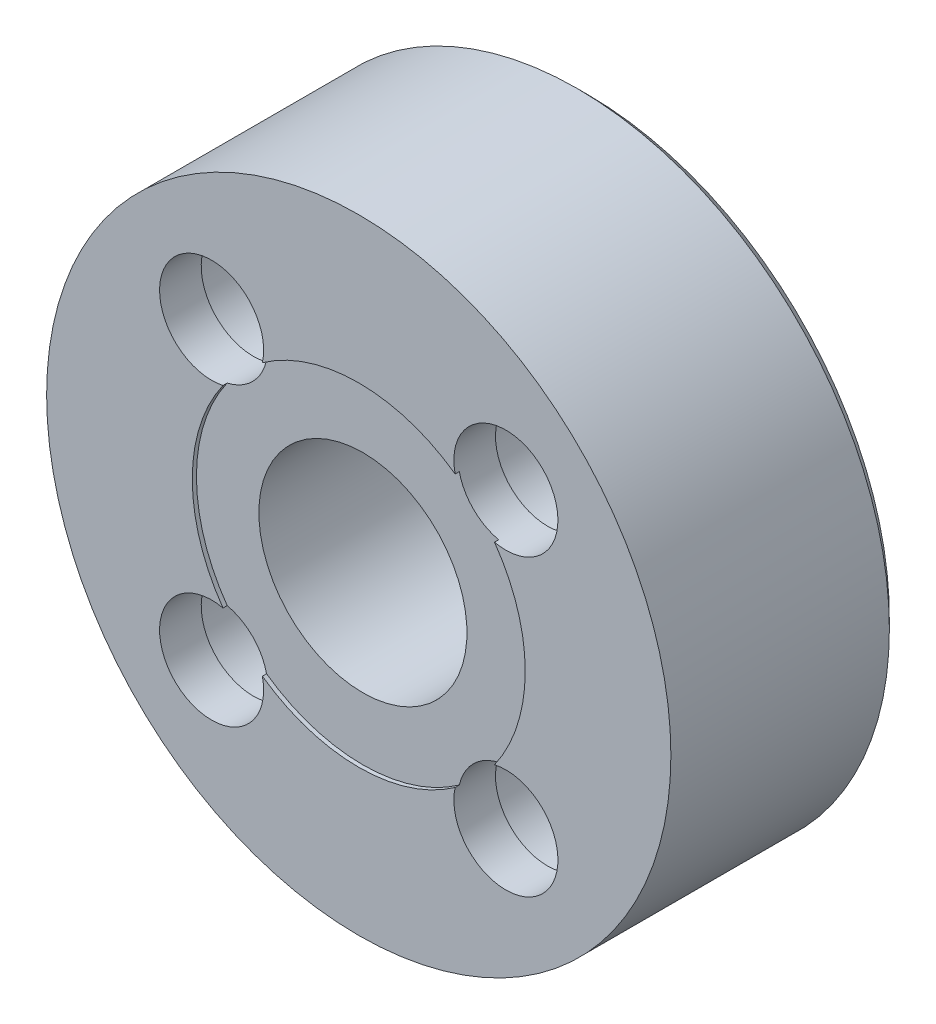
ISO-10303-21;
HEADER;
FILE_DESCRIPTION(('STEP AP214'),'2;1');
FILE_NAME('part.step','',(''),(''),'','','');
FILE_SCHEMA(('AUTOMOTIVE_DESIGN { 1 0 10303 214 1 1 1 1 }'));
ENDSEC;
DATA;
#1=APPLICATION_CONTEXT('core data for automotive mechanical design processes');
#2=APPLICATION_PROTOCOL_DEFINITION('international standard','automotive_design',2000,#1);
#3=PRODUCT_CONTEXT('',#1,'mechanical');
#4=PRODUCT('Part','Part','',(#3));
#5=PRODUCT_RELATED_PRODUCT_CATEGORY('part','',(#4));
#6=PRODUCT_DEFINITION_FORMATION('','',#4);
#7=PRODUCT_DEFINITION_CONTEXT('part definition',#1,'design');
#8=PRODUCT_DEFINITION('design','',#6,#7);
#9=PRODUCT_DEFINITION_SHAPE('','',#8);
#10=(LENGTH_UNIT() NAMED_UNIT(*) SI_UNIT(.MILLI.,.METRE.));
#11=(NAMED_UNIT(*) PLANE_ANGLE_UNIT() SI_UNIT($,.RADIAN.));
#12=(NAMED_UNIT(*) SI_UNIT($,.STERADIAN.) SOLID_ANGLE_UNIT());
#13=UNCERTAINTY_MEASURE_WITH_UNIT(LENGTH_MEASURE(1.E-05),#10,'distance_accuracy_value','');
#14=(GEOMETRIC_REPRESENTATION_CONTEXT(3) GLOBAL_UNCERTAINTY_ASSIGNED_CONTEXT((#13)) GLOBAL_UNIT_ASSIGNED_CONTEXT((#10,
#11,#12)) REPRESENTATION_CONTEXT('',''));
#15=CARTESIAN_POINT('',(0.,0.,0.));
#16=DIRECTION('',(0.,0.,1.));
#17=DIRECTION('',(1.,0.,0.));
#18=AXIS2_PLACEMENT_3D('',#15,#16,#17);
#19=CARTESIAN_POINT('',(0.,0.,0.));
#20=DIRECTION('',(0.,0.,-1.));
#21=DIRECTION('',(0.,-1.,0.));
#22=AXIS2_PLACEMENT_3D('',#19,#20,#21);
#23=CYLINDRICAL_SURFACE('',#22,5.);
#24=CARTESIAN_POINT('',(0.,0.,0.5));
#25=DIRECTION('',(0.,0.,1.));
#26=DIRECTION('',(0.,1.,0.));
#27=AXIS2_PLACEMENT_3D('',#24,#25,#26);
#28=CIRCLE('',#27,5.);
#29=CARTESIAN_POINT('',(0.,5.,0.5));
#30=VERTEX_POINT('',#29);
#31=EDGE_CURVE('E126',#30,#30,#28,.F.);
#32=ORIENTED_EDGE('',*,*,#31,.T.);
#33=EDGE_LOOP('',(#32));
#34=FACE_BOUND('',#33,.T.);
#35=CARTESIAN_POINT('',(0.,0.,10.8));
#36=DIRECTION('',(0.,0.,-1.));
#37=DIRECTION('',(0.,-1.,0.));
#38=AXIS2_PLACEMENT_3D('',#35,#36,#37);
#39=CIRCLE('',#38,5.);
#40=CARTESIAN_POINT('',(0.,-5.,10.8));
#41=VERTEX_POINT('',#40);
#42=EDGE_CURVE('E97',#41,#41,#39,.F.);
#43=ORIENTED_EDGE('',*,*,#42,.T.);
#44=EDGE_LOOP('',(#43));
#45=FACE_BOUND('',#44,.T.);
#46=ADVANCED_FACE('F14',(#34,#45),#23,.F.);
#47=CARTESIAN_POINT('',(-7.07106781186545,7.0710678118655,0.));
#48=DIRECTION('',(0.,0.,-1.));
#49=DIRECTION('',(0.,-1.,0.));
#50=AXIS2_PLACEMENT_3D('',#47,#48,#49);
#51=CYLINDRICAL_SURFACE('',#50,2.5);
#52=DIRECTION('',(0.,0.,-1.));
#53=VECTOR('',#52,1.);
#54=CARTESIAN_POINT('',(-4.63196253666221,6.52264693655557,15.8));
#55=LINE('',#54,#53);
#56=CARTESIAN_POINT('',(-4.63196253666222,6.52264693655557,10.8));
#57=VERTEX_POINT('',#56);
#58=CARTESIAN_POINT('',(-4.6319625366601,6.52264693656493,11.));
#59=VERTEX_POINT('',#58);
#60=EDGE_CURVE('E108',#57,#59,#55,.F.);
#61=ORIENTED_EDGE('',*,*,#60,.T.);
#62=CARTESIAN_POINT('',(-7.07106781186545,7.0710678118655,11.));
#63=DIRECTION('',(0.,0.,-1.));
#64=DIRECTION('',(0.,-1.,0.));
#65=AXIS2_PLACEMENT_3D('',#62,#63,#64);
#66=CIRCLE('',#65,2.5);
#67=CARTESIAN_POINT('',(-6.52264693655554,4.63196253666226,11.));
#68=VERTEX_POINT('',#67);
#69=EDGE_CURVE('E217',#59,#68,#66,.F.);
#70=ORIENTED_EDGE('',*,*,#69,.T.);
#71=DIRECTION('',(0.,0.,-1.));
#72=VECTOR('',#71,1.);
#73=CARTESIAN_POINT('',(-6.52264693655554,4.63196253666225,15.8));
#74=LINE('',#73,#72);
#75=CARTESIAN_POINT('',(-6.52264693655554,4.63196253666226,10.8));
#76=VERTEX_POINT('',#75);
#77=EDGE_CURVE('E111',#68,#76,#74,.T.);
#78=ORIENTED_EDGE('',*,*,#77,.T.);
#79=CARTESIAN_POINT('',(-7.07106781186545,7.0710678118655,10.8));
#80=DIRECTION('',(0.,0.,-1.));
#81=DIRECTION('',(0.,-1.,0.));
#82=AXIS2_PLACEMENT_3D('',#79,#80,#81);
#83=CIRCLE('',#82,2.5);
#84=EDGE_CURVE('E188',#76,#57,#83,.F.);
#85=ORIENTED_EDGE('',*,*,#84,.T.);
#86=EDGE_LOOP('',(#61,#70,#78,#85));
#87=FACE_BOUND('',#86,.T.);
#88=CARTESIAN_POINT('',(-7.07106781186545,7.0710678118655,9.));
#89=DIRECTION('',(0.,0.,-1.));
#90=DIRECTION('',(0.,-1.,0.));
#91=AXIS2_PLACEMENT_3D('',#88,#89,#90);
#92=CIRCLE('',#91,2.5);
#93=CARTESIAN_POINT('',(-7.07106781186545,4.5710678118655,9.));
#94=VERTEX_POINT('',#93);
#95=EDGE_CURVE('E164',#94,#94,#92,.F.);
#96=ORIENTED_EDGE('',*,*,#95,.F.);
#97=EDGE_LOOP('',(#96));
#98=FACE_BOUND('',#97,.T.);
#99=ADVANCED_FACE('F221',(#87,#98),#51,.F.);
#100=CARTESIAN_POINT('',(7.07106781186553,7.07106781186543,0.));
#101=DIRECTION('',(0.,0.,-1.));
#102=DIRECTION('',(0.,-1.,0.));
#103=AXIS2_PLACEMENT_3D('',#100,#101,#102);
#104=CYLINDRICAL_SURFACE('',#103,2.5);
#105=DIRECTION('',(0.,0.,-1.));
#106=VECTOR('',#105,1.);
#107=CARTESIAN_POINT('',(6.52264693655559,4.63196253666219,15.8));
#108=LINE('',#107,#106);
#109=CARTESIAN_POINT('',(6.52264693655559,4.63196253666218,10.8));
#110=VERTEX_POINT('',#109);
#111=CARTESIAN_POINT('',(6.52264693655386,4.63196253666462,11.));
#112=VERTEX_POINT('',#111);
#113=EDGE_CURVE('E96',#110,#112,#108,.F.);
#114=ORIENTED_EDGE('',*,*,#113,.T.);
#115=CARTESIAN_POINT('',(7.07106781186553,7.07106781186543,11.));
#116=DIRECTION('',(0.,0.,-1.));
#117=DIRECTION('',(0.,-1.,0.));
#118=AXIS2_PLACEMENT_3D('',#115,#116,#117);
#119=CIRCLE('',#118,2.5);
#120=CARTESIAN_POINT('',(4.63196253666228,6.52264693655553,11.));
#121=VERTEX_POINT('',#120);
#122=EDGE_CURVE('E212',#112,#121,#119,.F.);
#123=ORIENTED_EDGE('',*,*,#122,.T.);
#124=DIRECTION('',(0.,0.,-1.));
#125=VECTOR('',#124,1.);
#126=CARTESIAN_POINT('',(4.63196253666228,6.52264693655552,15.8));
#127=LINE('',#126,#125);
#128=CARTESIAN_POINT('',(4.63196253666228,6.52264693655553,10.8));
#129=VERTEX_POINT('',#128);
#130=EDGE_CURVE('E100',#121,#129,#127,.T.);
#131=ORIENTED_EDGE('',*,*,#130,.T.);
#132=CARTESIAN_POINT('',(7.07106781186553,7.07106781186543,10.8));
#133=DIRECTION('',(0.,0.,-1.));
#134=DIRECTION('',(0.,-1.,0.));
#135=AXIS2_PLACEMENT_3D('',#132,#133,#134);
#136=CIRCLE('',#135,2.5);
#137=EDGE_CURVE('E185',#129,#110,#136,.F.);
#138=ORIENTED_EDGE('',*,*,#137,.T.);
#139=EDGE_LOOP('',(#114,#123,#131,#138));
#140=FACE_BOUND('',#139,.T.);
#141=CARTESIAN_POINT('',(7.07106781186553,7.07106781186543,9.));
#142=DIRECTION('',(0.,0.,-1.));
#143=DIRECTION('',(0.,-1.,0.));
#144=AXIS2_PLACEMENT_3D('',#141,#142,#143);
#145=CIRCLE('',#144,2.5);
#146=CARTESIAN_POINT('',(7.07106781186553,4.57106781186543,9.));
#147=VERTEX_POINT('',#146);
#148=EDGE_CURVE('E157',#147,#147,#145,.F.);
#149=ORIENTED_EDGE('',*,*,#148,.F.);
#150=EDGE_LOOP('',(#149));
#151=FACE_BOUND('',#150,.T.);
#152=ADVANCED_FACE('F209',(#140,#151),#104,.F.);
#153=CARTESIAN_POINT('',(7.0710678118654,-7.07106781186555,0.));
#154=DIRECTION('',(0.,0.,-1.));
#155=DIRECTION('',(0.,-1.,0.));
#156=AXIS2_PLACEMENT_3D('',#153,#154,#155);
#157=CYLINDRICAL_SURFACE('',#156,2.5);
#158=DIRECTION('',(0.,0.,-1.));
#159=VECTOR('',#158,1.);
#160=CARTESIAN_POINT('',(4.63196253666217,-6.5226469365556,15.8));
#161=LINE('',#160,#159);
#162=CARTESIAN_POINT('',(4.63196253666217,-6.5226469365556,10.8));
#163=VERTEX_POINT('',#162);
#164=CARTESIAN_POINT('',(4.63196253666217,-6.5226469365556,11.));
#165=VERTEX_POINT('',#164);
#166=EDGE_CURVE('E140',#163,#165,#161,.F.);
#167=ORIENTED_EDGE('',*,*,#166,.T.);
#168=CARTESIAN_POINT('',(7.0710678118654,-7.07106781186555,11.));
#169=DIRECTION('',(0.,0.,-1.));
#170=DIRECTION('',(0.,-1.,0.));
#171=AXIS2_PLACEMENT_3D('',#168,#169,#170);
#172=CIRCLE('',#171,2.5);
#173=CARTESIAN_POINT('',(6.5226469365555,-4.6319625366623,11.));
#174=VERTEX_POINT('',#173);
#175=EDGE_CURVE('E83',#165,#174,#172,.F.);
#176=ORIENTED_EDGE('',*,*,#175,.T.);
#177=DIRECTION('',(0.,0.,-1.));
#178=VECTOR('',#177,1.);
#179=CARTESIAN_POINT('',(6.52264693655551,-4.6319625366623,15.8));
#180=LINE('',#179,#178);
#181=CARTESIAN_POINT('',(6.5226469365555,-4.63196253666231,10.8));
#182=VERTEX_POINT('',#181);
#183=EDGE_CURVE('E21',#174,#182,#180,.T.);
#184=ORIENTED_EDGE('',*,*,#183,.T.);
#185=CARTESIAN_POINT('',(7.0710678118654,-7.07106781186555,10.8));
#186=DIRECTION('',(0.,0.,-1.));
#187=DIRECTION('',(0.,-1.,0.));
#188=AXIS2_PLACEMENT_3D('',#185,#186,#187);
#189=CIRCLE('',#188,2.5);
#190=EDGE_CURVE('E138',#182,#163,#189,.F.);
#191=ORIENTED_EDGE('',*,*,#190,.T.);
#192=EDGE_LOOP('',(#167,#176,#184,#191));
#193=FACE_BOUND('',#192,.T.);
#194=CARTESIAN_POINT('',(7.0710678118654,-7.07106781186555,9.));
#195=DIRECTION('',(0.,0.,-1.));
#196=DIRECTION('',(0.,-1.,0.));
#197=AXIS2_PLACEMENT_3D('',#194,#195,#196);
#198=CIRCLE('',#197,2.5);
#199=CARTESIAN_POINT('',(7.0710678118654,-9.57106781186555,9.));
#200=VERTEX_POINT('',#199);
#201=EDGE_CURVE('E150',#200,#200,#198,.F.);
#202=ORIENTED_EDGE('',*,*,#201,.F.);
#203=EDGE_LOOP('',(#202));
#204=FACE_BOUND('',#203,.T.);
#205=ADVANCED_FACE('F288',(#193,#204),#157,.F.);
#206=CARTESIAN_POINT('',(-7.07106781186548,-7.07106781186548,0.));
#207=DIRECTION('',(0.,0.,-1.));
#208=DIRECTION('',(0.,-1.,0.));
#209=AXIS2_PLACEMENT_3D('',#206,#207,#208);
#210=CYLINDRICAL_SURFACE('',#209,2.5);
#211=DIRECTION('',(0.,0.,-1.));
#212=VECTOR('',#211,1.);
#213=CARTESIAN_POINT('',(-6.52264693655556,-4.63196253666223,15.8));
#214=LINE('',#213,#212);
#215=CARTESIAN_POINT('',(-6.52264693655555,-4.63196253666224,10.8));
#216=VERTEX_POINT('',#215);
#217=CARTESIAN_POINT('',(-6.52264693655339,-4.63196253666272,11.));
#218=VERTEX_POINT('',#217);
#219=EDGE_CURVE('E93',#216,#218,#214,.F.);
#220=ORIENTED_EDGE('',*,*,#219,.T.);
#221=CARTESIAN_POINT('',(-7.07106781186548,-7.07106781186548,11.));
#222=DIRECTION('',(0.,0.,-1.));
#223=DIRECTION('',(0.,-1.,0.));
#224=AXIS2_PLACEMENT_3D('',#221,#222,#223);
#225=CIRCLE('',#224,2.5);
#226=CARTESIAN_POINT('',(-4.63196253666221,-6.52264693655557,11.));
#227=VERTEX_POINT('',#226);
#228=EDGE_CURVE('E81',#218,#227,#225,.F.);
#229=ORIENTED_EDGE('',*,*,#228,.T.);
#230=DIRECTION('',(0.,0.,-1.));
#231=VECTOR('',#230,1.);
#232=CARTESIAN_POINT('',(-4.63196253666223,-6.52264693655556,15.8));
#233=LINE('',#232,#231);
#234=CARTESIAN_POINT('',(-4.63196253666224,-6.52264693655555,10.8));
#235=VERTEX_POINT('',#234);
#236=EDGE_CURVE('E92',#227,#235,#233,.T.);
#237=ORIENTED_EDGE('',*,*,#236,.T.);
#238=CARTESIAN_POINT('',(-7.07106781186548,-7.07106781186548,10.8));
#239=DIRECTION('',(0.,0.,-1.));
#240=DIRECTION('',(0.,-1.,0.));
#241=AXIS2_PLACEMENT_3D('',#238,#239,#240);
#242=CIRCLE('',#241,2.5);
#243=EDGE_CURVE('E103',#235,#216,#242,.F.);
#244=ORIENTED_EDGE('',*,*,#243,.T.);
#245=EDGE_LOOP('',(#220,#229,#237,#244));
#246=FACE_BOUND('',#245,.T.);
#247=CARTESIAN_POINT('',(-7.07106781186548,-7.07106781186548,9.));
#248=DIRECTION('',(0.,0.,-1.));
#249=DIRECTION('',(0.,-1.,0.));
#250=AXIS2_PLACEMENT_3D('',#247,#248,#249);
#251=CIRCLE('',#250,2.5);
#252=CARTESIAN_POINT('',(-7.07106781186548,-9.57106781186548,9.));
#253=VERTEX_POINT('',#252);
#254=EDGE_CURVE('E143',#253,#253,#251,.F.);
#255=ORIENTED_EDGE('',*,*,#254,.F.);
#256=EDGE_LOOP('',(#255));
#257=FACE_BOUND('',#256,.T.);
#258=ADVANCED_FACE('F89',(#246,#257),#210,.F.);
#259=CARTESIAN_POINT('',(0.,0.,0.));
#260=DIRECTION('',(0.,0.,-1.));
#261=DIRECTION('',(0.,-1.,0.));
#262=AXIS2_PLACEMENT_3D('',#259,#260,#261);
#263=CYLINDRICAL_SURFACE('',#262,15.);
#264=CARTESIAN_POINT('',(0.,0.,11.));
#265=DIRECTION('',(0.,0.,-1.));
#266=DIRECTION('',(0.,-1.,0.));
#267=AXIS2_PLACEMENT_3D('',#264,#265,#266);
#268=CIRCLE('',#267,15.);
#269=CARTESIAN_POINT('',(0.,-15.,11.));
#270=VERTEX_POINT('',#269);
#271=EDGE_CURVE('E216',#270,#270,#268,.T.);
#272=ORIENTED_EDGE('',*,*,#271,.T.);
#273=EDGE_LOOP('',(#272));
#274=FACE_BOUND('',#273,.T.);
#275=CARTESIAN_POINT('',(0.,0.,0.5));
#276=DIRECTION('',(0.,0.,1.));
#277=DIRECTION('',(0.,1.,0.));
#278=AXIS2_PLACEMENT_3D('',#275,#276,#277);
#279=CIRCLE('',#278,15.);
#280=CARTESIAN_POINT('',(0.,15.,0.5));
#281=VERTEX_POINT('',#280);
#282=EDGE_CURVE('E135',#281,#281,#279,.T.);
#283=ORIENTED_EDGE('',*,*,#282,.T.);
#284=EDGE_LOOP('',(#283));
#285=FACE_BOUND('',#284,.T.);
#286=ADVANCED_FACE('F306',(#274,#285),#263,.T.);
#287=CARTESIAN_POINT('',(0.,5.,0.));
#288=DIRECTION('',(0.,0.,1.));
#289=DIRECTION('',(0.,1.,0.));
#290=AXIS2_PLACEMENT_3D('',#287,#288,#289);
#291=PLANE('',#290);
#292=CARTESIAN_POINT('',(0.,0.,0.));
#293=DIRECTION('',(0.,0.,1.));
#294=DIRECTION('',(0.,1.,0.));
#295=AXIS2_PLACEMENT_3D('',#292,#293,#294);
#296=CIRCLE('',#295,14.5);
#297=CARTESIAN_POINT('',(0.,14.5,0.));
#298=VERTEX_POINT('',#297);
#299=EDGE_CURVE('E132',#298,#298,#296,.F.);
#300=ORIENTED_EDGE('',*,*,#299,.T.);
#301=EDGE_LOOP('',(#300));
#302=FACE_BOUND('',#301,.T.);
#303=CARTESIAN_POINT('',(0.,0.,0.));
#304=DIRECTION('',(0.,0.,1.));
#305=DIRECTION('',(0.,1.,0.));
#306=AXIS2_PLACEMENT_3D('',#303,#304,#305);
#307=CIRCLE('',#306,5.5);
#308=CARTESIAN_POINT('',(0.,5.5,0.));
#309=VERTEX_POINT('',#308);
#310=EDGE_CURVE('E129',#309,#309,#307,.T.);
#311=ORIENTED_EDGE('',*,*,#310,.T.);
#312=EDGE_LOOP('',(#311));
#313=FACE_BOUND('',#312,.T.);
#314=CARTESIAN_POINT('',(7.0710678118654,-7.07106781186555,0.));
#315=DIRECTION('',(0.,0.,-1.));
#316=DIRECTION('',(0.,-1.,0.));
#317=AXIS2_PLACEMENT_3D('',#314,#315,#316);
#318=CIRCLE('',#317,3.5);
#319=CARTESIAN_POINT('',(7.0710678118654,-10.5710678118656,0.));
#320=VERTEX_POINT('',#319);
#321=EDGE_CURVE('E114',#320,#320,#318,.T.);
#322=ORIENTED_EDGE('',*,*,#321,.F.);
#323=EDGE_LOOP('',(#322));
#324=FACE_BOUND('',#323,.T.);
#325=CARTESIAN_POINT('',(7.07106781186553,7.07106781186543,0.));
#326=DIRECTION('',(0.,0.,-1.));
#327=DIRECTION('',(0.,-1.,0.));
#328=AXIS2_PLACEMENT_3D('',#325,#326,#327);
#329=CIRCLE('',#328,3.5);
#330=CARTESIAN_POINT('',(7.07106781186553,3.57106781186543,0.));
#331=VERTEX_POINT('',#330);
#332=EDGE_CURVE('E117',#331,#331,#329,.T.);
#333=ORIENTED_EDGE('',*,*,#332,.F.);
#334=EDGE_LOOP('',(#333));
#335=FACE_BOUND('',#334,.T.);
#336=CARTESIAN_POINT('',(-7.07106781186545,7.0710678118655,0.));
#337=DIRECTION('',(0.,0.,-1.));
#338=DIRECTION('',(0.,-1.,0.));
#339=AXIS2_PLACEMENT_3D('',#336,#337,#338);
#340=CIRCLE('',#339,3.5);
#341=CARTESIAN_POINT('',(-7.07106781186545,3.5710678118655,0.));
#342=VERTEX_POINT('',#341);
#343=EDGE_CURVE('E120',#342,#342,#340,.T.);
#344=ORIENTED_EDGE('',*,*,#343,.F.);
#345=EDGE_LOOP('',(#344));
#346=FACE_BOUND('',#345,.T.);
#347=CARTESIAN_POINT('',(-7.07106781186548,-7.07106781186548,0.));
#348=DIRECTION('',(0.,0.,-1.));
#349=DIRECTION('',(0.,-1.,0.));
#350=AXIS2_PLACEMENT_3D('',#347,#348,#349);
#351=CIRCLE('',#350,3.5);
#352=CARTESIAN_POINT('',(-7.07106781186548,-10.5710678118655,0.));
#353=VERTEX_POINT('',#352);
#354=EDGE_CURVE('E123',#353,#353,#351,.T.);
#355=ORIENTED_EDGE('',*,*,#354,.F.);
#356=EDGE_LOOP('',(#355));
#357=FACE_BOUND('',#356,.T.);
#358=ADVANCED_FACE('F309',(#302,#313,#324,#335,#346,#357),#291,.F.);
#359=CARTESIAN_POINT('',(-7.07106781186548,-7.07106781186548,0.));
#360=DIRECTION('',(0.,0.,-1.));
#361=DIRECTION('',(0.,-1.,0.));
#362=AXIS2_PLACEMENT_3D('',#359,#360,#361);
#363=CONICAL_SURFACE('',#362,3.5,0.785398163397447);
#364=CARTESIAN_POINT('',(-7.07106781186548,-7.07106781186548,0.5));
#365=DIRECTION('',(0.,0.,-1.));
#366=DIRECTION('',(0.,-1.,0.));
#367=AXIS2_PLACEMENT_3D('',#364,#365,#366);
#368=CIRCLE('',#367,3.);
#369=CARTESIAN_POINT('',(-7.07106781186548,-10.0710678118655,0.5));
#370=VERTEX_POINT('',#369);
#371=EDGE_CURVE('E146',#370,#370,#368,.F.);
#372=ORIENTED_EDGE('',*,*,#371,.T.);
#373=EDGE_LOOP('',(#372));
#374=FACE_BOUND('',#373,.T.);
#375=ORIENTED_EDGE('',*,*,#354,.T.);
#376=EDGE_LOOP('',(#375));
#377=FACE_BOUND('',#376,.T.);
#378=ADVANCED_FACE('F303',(#374,#377),#363,.F.);
#379=CARTESIAN_POINT('',(-7.07106781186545,7.0710678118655,0.));
#380=DIRECTION('',(0.,0.,-1.));
#381=DIRECTION('',(0.,-1.,0.));
#382=AXIS2_PLACEMENT_3D('',#379,#380,#381);
#383=CONICAL_SURFACE('',#382,3.5,0.785398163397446);
#384=CARTESIAN_POINT('',(-7.07106781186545,7.0710678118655,0.5));
#385=DIRECTION('',(0.,0.,-1.));
#386=DIRECTION('',(0.,-1.,0.));
#387=AXIS2_PLACEMENT_3D('',#384,#385,#386);
#388=CIRCLE('',#387,3.);
#389=CARTESIAN_POINT('',(-7.07106781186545,4.0710678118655,0.5));
#390=VERTEX_POINT('',#389);
#391=EDGE_CURVE('E166',#390,#390,#388,.F.);
#392=ORIENTED_EDGE('',*,*,#391,.T.);
#393=EDGE_LOOP('',(#392));
#394=FACE_BOUND('',#393,.T.);
#395=ORIENTED_EDGE('',*,*,#343,.T.);
#396=EDGE_LOOP('',(#395));
#397=FACE_BOUND('',#396,.T.);
#398=ADVANCED_FACE('F298',(#394,#397),#383,.F.);
#399=CARTESIAN_POINT('',(7.07106781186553,7.07106781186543,0.));
#400=DIRECTION('',(0.,0.,-1.));
#401=DIRECTION('',(0.,-1.,0.));
#402=AXIS2_PLACEMENT_3D('',#399,#400,#401);
#403=CONICAL_SURFACE('',#402,3.5,0.785398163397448);
#404=CARTESIAN_POINT('',(7.07106781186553,7.07106781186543,0.5));
#405=DIRECTION('',(0.,0.,-1.));
#406=DIRECTION('',(0.,-1.,0.));
#407=AXIS2_PLACEMENT_3D('',#404,#405,#406);
#408=CIRCLE('',#407,3.);
#409=CARTESIAN_POINT('',(7.07106781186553,4.07106781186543,0.5));
#410=VERTEX_POINT('',#409);
#411=EDGE_CURVE('E160',#410,#410,#408,.F.);
#412=ORIENTED_EDGE('',*,*,#411,.T.);
#413=EDGE_LOOP('',(#412));
#414=FACE_BOUND('',#413,.T.);
#415=ORIENTED_EDGE('',*,*,#332,.T.);
#416=EDGE_LOOP('',(#415));
#417=FACE_BOUND('',#416,.T.);
#418=ADVANCED_FACE('F293',(#414,#417),#403,.F.);
#419=CARTESIAN_POINT('',(7.0710678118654,-7.07106781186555,0.));
#420=DIRECTION('',(0.,0.,-1.));
#421=DIRECTION('',(0.,-1.,0.));
#422=AXIS2_PLACEMENT_3D('',#419,#420,#421);
#423=CONICAL_SURFACE('',#422,3.5,0.785398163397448);
#424=CARTESIAN_POINT('',(7.0710678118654,-7.07106781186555,0.5));
#425=DIRECTION('',(0.,0.,-1.));
#426=DIRECTION('',(0.,-1.,0.));
#427=AXIS2_PLACEMENT_3D('',#424,#425,#426);
#428=CIRCLE('',#427,3.);
#429=CARTESIAN_POINT('',(7.0710678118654,-10.0710678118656,0.5));
#430=VERTEX_POINT('',#429);
#431=EDGE_CURVE('E153',#430,#430,#428,.F.);
#432=ORIENTED_EDGE('',*,*,#431,.T.);
#433=EDGE_LOOP('',(#432));
#434=FACE_BOUND('',#433,.T.);
#435=ORIENTED_EDGE('',*,*,#321,.T.);
#436=EDGE_LOOP('',(#435));
#437=FACE_BOUND('',#436,.T.);
#438=ADVANCED_FACE('F286',(#434,#437),#423,.F.);
#439=CARTESIAN_POINT('',(0.,0.,0.5));
#440=DIRECTION('',(0.,0.,-1.));
#441=DIRECTION('',(0.,-1.,0.));
#442=AXIS2_PLACEMENT_3D('',#439,#440,#441);
#443=CONICAL_SURFACE('',#442,5.,0.78539816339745);
#444=ORIENTED_EDGE('',*,*,#310,.F.);
#445=EDGE_LOOP('',(#444));
#446=FACE_BOUND('',#445,.T.);
#447=ORIENTED_EDGE('',*,*,#31,.F.);
#448=EDGE_LOOP('',(#447));
#449=FACE_BOUND('',#448,.T.);
#450=ADVANCED_FACE('F282',(#446,#449),#443,.F.);
#451=CARTESIAN_POINT('',(0.,0.,0.));
#452=DIRECTION('',(0.,0.,1.));
#453=DIRECTION('',(0.,1.,0.));
#454=AXIS2_PLACEMENT_3D('',#451,#452,#453);
#455=CONICAL_SURFACE('',#454,14.5,0.785398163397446);
#456=ORIENTED_EDGE('',*,*,#282,.F.);
#457=EDGE_LOOP('',(#456));
#458=FACE_BOUND('',#457,.T.);
#459=ORIENTED_EDGE('',*,*,#299,.F.);
#460=EDGE_LOOP('',(#459));
#461=FACE_BOUND('',#460,.T.);
#462=ADVANCED_FACE('F279',(#458,#461),#455,.T.);
#463=CARTESIAN_POINT('',(0.,0.,20.8));
#464=DIRECTION('',(0.,0.,-1.));
#465=DIRECTION('',(0.,-1.,0.));
#466=AXIS2_PLACEMENT_3D('',#463,#464,#465);
#467=CYLINDRICAL_SURFACE('',#466,8.);
#468=ORIENTED_EDGE('',*,*,#77,.F.);
#469=CARTESIAN_POINT('',(0.,0.,11.));
#470=DIRECTION('',(0.,0.,-1.));
#471=DIRECTION('',(0.,-1.,0.));
#472=AXIS2_PLACEMENT_3D('',#469,#470,#471);
#473=CIRCLE('',#472,8.);
#474=EDGE_CURVE('E224',#68,#218,#473,.F.);
#475=ORIENTED_EDGE('',*,*,#474,.T.);
#476=ORIENTED_EDGE('',*,*,#219,.F.);
#477=CARTESIAN_POINT('',(0.,0.,10.8));
#478=DIRECTION('',(0.,0.,-1.));
#479=DIRECTION('',(0.,-1.,0.));
#480=AXIS2_PLACEMENT_3D('',#477,#478,#479);
#481=CIRCLE('',#480,8.);
#482=EDGE_CURVE('E184',#216,#76,#481,.T.);
#483=ORIENTED_EDGE('',*,*,#482,.T.);
#484=EDGE_LOOP('',(#468,#475,#476,#483));
#485=FACE_BOUND('',#484,.T.);
#486=ADVANCED_FACE('F223',(#485),#467,.F.);
#487=ORIENTED_EDGE('',*,*,#130,.F.);
#488=CARTESIAN_POINT('',(0.,0.,11.));
#489=DIRECTION('',(0.,0.,-1.));
#490=DIRECTION('',(0.,-1.,0.));
#491=AXIS2_PLACEMENT_3D('',#488,#489,#490);
#492=CIRCLE('',#491,8.);
#493=EDGE_CURVE('E215',#121,#59,#492,.F.);
#494=ORIENTED_EDGE('',*,*,#493,.T.);
#495=ORIENTED_EDGE('',*,*,#60,.F.);
#496=EDGE_CURVE('E198',#57,#129,#481,.T.);
#497=ORIENTED_EDGE('',*,*,#496,.T.);
#498=EDGE_LOOP('',(#487,#494,#495,#497));
#499=FACE_BOUND('',#498,.T.);
#500=ADVANCED_FACE('F214',(#499),#467,.F.);
#501=ORIENTED_EDGE('',*,*,#183,.F.);
#502=CARTESIAN_POINT('',(0.,0.,11.));
#503=DIRECTION('',(0.,0.,-1.));
#504=DIRECTION('',(0.,-1.,0.));
#505=AXIS2_PLACEMENT_3D('',#502,#503,#504);
#506=CIRCLE('',#505,8.);
#507=EDGE_CURVE('E225',#174,#112,#506,.F.);
#508=ORIENTED_EDGE('',*,*,#507,.T.);
#509=ORIENTED_EDGE('',*,*,#113,.F.);
#510=EDGE_CURVE('E183',#110,#182,#481,.T.);
#511=ORIENTED_EDGE('',*,*,#510,.T.);
#512=EDGE_LOOP('',(#501,#508,#509,#511));
#513=FACE_BOUND('',#512,.T.);
#514=ADVANCED_FACE('F205',(#513),#467,.F.);
#515=CARTESIAN_POINT('',(0.,0.,11.));
#516=DIRECTION('',(0.,0.,-1.));
#517=DIRECTION('',(0.,-1.,0.));
#518=AXIS2_PLACEMENT_3D('',#515,#516,#517);
#519=CIRCLE('',#518,8.);
#520=EDGE_CURVE('E9',#227,#165,#519,.F.);
#521=ORIENTED_EDGE('',*,*,#520,.T.);
#522=ORIENTED_EDGE('',*,*,#166,.F.);
#523=EDGE_CURVE('E28',#163,#235,#481,.T.);
#524=ORIENTED_EDGE('',*,*,#523,.T.);
#525=ORIENTED_EDGE('',*,*,#236,.F.);
#526=EDGE_LOOP('',(#521,#522,#524,#525));
#527=FACE_BOUND('',#526,.T.);
#528=ADVANCED_FACE('F95',(#527),#467,.F.);
#529=CARTESIAN_POINT('',(0.,0.,10.8));
#530=DIRECTION('',(0.,0.,-1.));
#531=DIRECTION('',(0.,-1.,0.));
#532=AXIS2_PLACEMENT_3D('',#529,#530,#531);
#533=PLANE('',#532);
#534=ORIENTED_EDGE('',*,*,#523,.F.);
#535=ORIENTED_EDGE('',*,*,#190,.F.);
#536=ORIENTED_EDGE('',*,*,#510,.F.);
#537=ORIENTED_EDGE('',*,*,#137,.F.);
#538=ORIENTED_EDGE('',*,*,#496,.F.);
#539=ORIENTED_EDGE('',*,*,#84,.F.);
#540=ORIENTED_EDGE('',*,*,#482,.F.);
#541=ORIENTED_EDGE('',*,*,#243,.F.);
#542=EDGE_LOOP('',(#534,#535,#536,#537,#538,#539,#540,#541));
#543=FACE_BOUND('',#542,.T.);
#544=ORIENTED_EDGE('',*,*,#42,.F.);
#545=EDGE_LOOP('',(#544));
#546=FACE_BOUND('',#545,.T.);
#547=ADVANCED_FACE('F191',(#543,#546),#533,.F.);
#548=CARTESIAN_POINT('',(-7.07106781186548,-7.07106781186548,9.));
#549=DIRECTION('',(0.,0.,-1.));
#550=DIRECTION('',(0.,-1.,0.));
#551=AXIS2_PLACEMENT_3D('',#548,#549,#550);
#552=CYLINDRICAL_SURFACE('',#551,3.);
#553=CARTESIAN_POINT('',(-7.07106781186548,-7.07106781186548,9.));
#554=DIRECTION('',(0.,0.,-1.));
#555=DIRECTION('',(0.,-1.,0.));
#556=AXIS2_PLACEMENT_3D('',#553,#554,#555);
#557=CIRCLE('',#556,3.);
#558=CARTESIAN_POINT('',(-7.07106781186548,-10.0710678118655,9.));
#559=VERTEX_POINT('',#558);
#560=EDGE_CURVE('E147',#559,#559,#557,.T.);
#561=ORIENTED_EDGE('',*,*,#560,.F.);
#562=EDGE_LOOP('',(#561));
#563=FACE_BOUND('',#562,.T.);
#564=ORIENTED_EDGE('',*,*,#371,.F.);
#565=EDGE_LOOP('',(#564));
#566=FACE_BOUND('',#565,.T.);
#567=ADVANCED_FACE('F265',(#563,#566),#552,.F.);
#568=CARTESIAN_POINT('',(-7.07106781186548,-7.07106781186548,9.));
#569=DIRECTION('',(0.,0.,-1.));
#570=DIRECTION('',(0.,-1.,0.));
#571=AXIS2_PLACEMENT_3D('',#568,#569,#570);
#572=PLANE('',#571);
#573=ORIENTED_EDGE('',*,*,#560,.T.);
#574=EDGE_LOOP('',(#573));
#575=FACE_BOUND('',#574,.T.);
#576=ORIENTED_EDGE('',*,*,#254,.T.);
#577=EDGE_LOOP('',(#576));
#578=FACE_BOUND('',#577,.T.);
#579=ADVANCED_FACE('F272',(#575,#578),#572,.T.);
#580=CARTESIAN_POINT('',(7.0710678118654,-7.07106781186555,9.));
#581=DIRECTION('',(0.,0.,-1.));
#582=DIRECTION('',(0.,-1.,0.));
#583=AXIS2_PLACEMENT_3D('',#580,#581,#582);
#584=CYLINDRICAL_SURFACE('',#583,3.);
#585=CARTESIAN_POINT('',(7.0710678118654,-7.07106781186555,9.));
#586=DIRECTION('',(0.,0.,-1.));
#587=DIRECTION('',(0.,-1.,0.));
#588=AXIS2_PLACEMENT_3D('',#585,#586,#587);
#589=CIRCLE('',#588,3.);
#590=CARTESIAN_POINT('',(7.0710678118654,-10.0710678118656,9.));
#591=VERTEX_POINT('',#590);
#592=EDGE_CURVE('E154',#591,#591,#589,.T.);
#593=ORIENTED_EDGE('',*,*,#592,.F.);
#594=EDGE_LOOP('',(#593));
#595=FACE_BOUND('',#594,.T.);
#596=ORIENTED_EDGE('',*,*,#431,.F.);
#597=EDGE_LOOP('',(#596));
#598=FACE_BOUND('',#597,.T.);
#599=ADVANCED_FACE('F412',(#595,#598),#584,.F.);
#600=CARTESIAN_POINT('',(7.0710678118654,-7.07106781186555,9.));
#601=DIRECTION('',(0.,0.,-1.));
#602=DIRECTION('',(0.,-1.,0.));
#603=AXIS2_PLACEMENT_3D('',#600,#601,#602);
#604=PLANE('',#603);
#605=ORIENTED_EDGE('',*,*,#592,.T.);
#606=EDGE_LOOP('',(#605));
#607=FACE_BOUND('',#606,.T.);
#608=ORIENTED_EDGE('',*,*,#201,.T.);
#609=EDGE_LOOP('',(#608));
#610=FACE_BOUND('',#609,.T.);
#611=ADVANCED_FACE('F421',(#607,#610),#604,.T.);
#612=CARTESIAN_POINT('',(7.07106781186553,7.07106781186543,9.));
#613=DIRECTION('',(0.,0.,-1.));
#614=DIRECTION('',(0.,-1.,0.));
#615=AXIS2_PLACEMENT_3D('',#612,#613,#614);
#616=CYLINDRICAL_SURFACE('',#615,3.);
#617=CARTESIAN_POINT('',(7.07106781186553,7.07106781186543,9.));
#618=DIRECTION('',(0.,0.,-1.));
#619=DIRECTION('',(0.,-1.,0.));
#620=AXIS2_PLACEMENT_3D('',#617,#618,#619);
#621=CIRCLE('',#620,3.);
#622=CARTESIAN_POINT('',(7.07106781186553,4.07106781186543,9.));
#623=VERTEX_POINT('',#622);
#624=EDGE_CURVE('E161',#623,#623,#621,.T.);
#625=ORIENTED_EDGE('',*,*,#624,.F.);
#626=EDGE_LOOP('',(#625));
#627=FACE_BOUND('',#626,.T.);
#628=ORIENTED_EDGE('',*,*,#411,.F.);
#629=EDGE_LOOP('',(#628));
#630=FACE_BOUND('',#629,.T.);
#631=ADVANCED_FACE('F252',(#627,#630),#616,.F.);
#632=CARTESIAN_POINT('',(7.07106781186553,7.07106781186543,9.));
#633=DIRECTION('',(0.,0.,-1.));
#634=DIRECTION('',(0.,-1.,0.));
#635=AXIS2_PLACEMENT_3D('',#632,#633,#634);
#636=PLANE('',#635);
#637=ORIENTED_EDGE('',*,*,#624,.T.);
#638=EDGE_LOOP('',(#637));
#639=FACE_BOUND('',#638,.T.);
#640=ORIENTED_EDGE('',*,*,#148,.T.);
#641=EDGE_LOOP('',(#640));
#642=FACE_BOUND('',#641,.T.);
#643=ADVANCED_FACE('F243',(#639,#642),#636,.T.);
#644=CARTESIAN_POINT('',(-7.07106781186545,7.0710678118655,9.));
#645=DIRECTION('',(0.,0.,-1.));
#646=DIRECTION('',(0.,-1.,0.));
#647=AXIS2_PLACEMENT_3D('',#644,#645,#646);
#648=CYLINDRICAL_SURFACE('',#647,3.);
#649=CARTESIAN_POINT('',(-7.07106781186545,7.0710678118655,9.));
#650=DIRECTION('',(0.,0.,-1.));
#651=DIRECTION('',(0.,-1.,0.));
#652=AXIS2_PLACEMENT_3D('',#649,#650,#651);
#653=CIRCLE('',#652,3.);
#654=CARTESIAN_POINT('',(-7.07106781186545,4.0710678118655,9.));
#655=VERTEX_POINT('',#654);
#656=EDGE_CURVE('E167',#655,#655,#653,.T.);
#657=ORIENTED_EDGE('',*,*,#656,.F.);
#658=EDGE_LOOP('',(#657));
#659=FACE_BOUND('',#658,.T.);
#660=ORIENTED_EDGE('',*,*,#391,.F.);
#661=EDGE_LOOP('',(#660));
#662=FACE_BOUND('',#661,.T.);
#663=ADVANCED_FACE('F240',(#659,#662),#648,.F.);
#664=CARTESIAN_POINT('',(-7.07106781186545,7.0710678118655,9.));
#665=DIRECTION('',(0.,0.,-1.));
#666=DIRECTION('',(0.,-1.,0.));
#667=AXIS2_PLACEMENT_3D('',#664,#665,#666);
#668=PLANE('',#667);
#669=ORIENTED_EDGE('',*,*,#656,.T.);
#670=EDGE_LOOP('',(#669));
#671=FACE_BOUND('',#670,.T.);
#672=ORIENTED_EDGE('',*,*,#95,.T.);
#673=EDGE_LOOP('',(#672));
#674=FACE_BOUND('',#673,.T.);
#675=ADVANCED_FACE('F237',(#671,#674),#668,.T.);
#676=CARTESIAN_POINT('',(20.,-20.6727387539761,11.));
#677=DIRECTION('',(0.,0.,-1.));
#678=DIRECTION('',(0.,-1.,0.));
#679=AXIS2_PLACEMENT_3D('',#676,#677,#678);
#680=PLANE('',#679);
#681=ORIENTED_EDGE('',*,*,#493,.F.);
#682=ORIENTED_EDGE('',*,*,#122,.F.);
#683=ORIENTED_EDGE('',*,*,#507,.F.);
#684=ORIENTED_EDGE('',*,*,#175,.F.);
#685=ORIENTED_EDGE('',*,*,#520,.F.);
#686=ORIENTED_EDGE('',*,*,#228,.F.);
#687=ORIENTED_EDGE('',*,*,#474,.F.);
#688=ORIENTED_EDGE('',*,*,#69,.F.);
#689=EDGE_LOOP('',(#681,#682,#683,#684,#685,#686,#687,#688));
#690=FACE_BOUND('',#689,.T.);
#691=ORIENTED_EDGE('',*,*,#271,.F.);
#692=EDGE_LOOP('',(#691));
#693=FACE_BOUND('',#692,.T.);
#694=ADVANCED_FACE('F79',(#690,#693),#680,.F.);
#695=CLOSED_SHELL('',(#46,#99,#152,#205,#258,#286,#358,#378,#398,#418,#438,#450,#462,#486,#500,
#514,#528,#547,#567,#579,#599,#611,#631,#643,#663,#675,#694));
#696=MANIFOLD_SOLID_BREP('B1',#695);
#697=ADVANCED_BREP_SHAPE_REPRESENTATION('',(#18,#696),#14);
#698=SHAPE_DEFINITION_REPRESENTATION(#9,#697);
ENDSEC;
END-ISO-10303-21;
